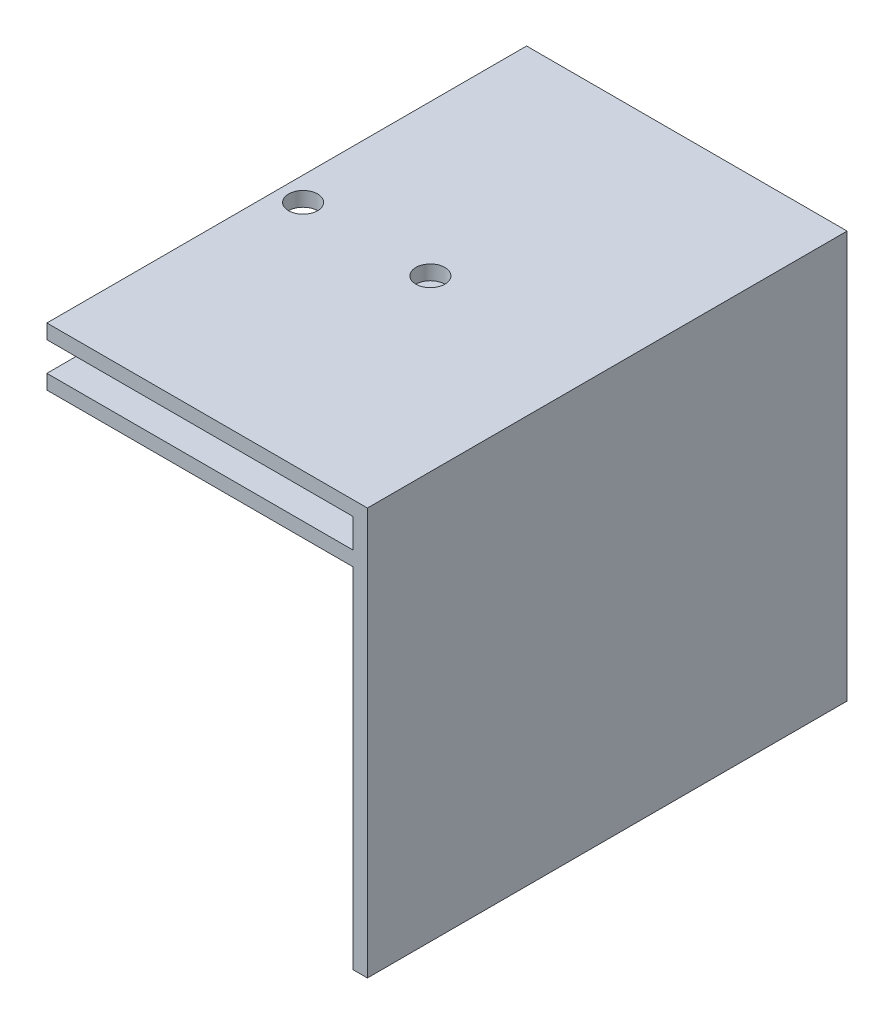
ISO-10303-21;
HEADER;
FILE_DESCRIPTION(('STEP AP214'),'2;1');
FILE_NAME('part.step','',(''),(''),'','','');
FILE_SCHEMA(('AUTOMOTIVE_DESIGN { 1 0 10303 214 1 1 1 1 }'));
ENDSEC;
DATA;
#1=APPLICATION_CONTEXT('core data for automotive mechanical design processes');
#2=APPLICATION_PROTOCOL_DEFINITION('international standard','automotive_design',2000,#1);
#3=PRODUCT_CONTEXT('',#1,'mechanical');
#4=PRODUCT('Part','Part','',(#3));
#5=PRODUCT_RELATED_PRODUCT_CATEGORY('part','',(#4));
#6=PRODUCT_DEFINITION_FORMATION('','',#4);
#7=PRODUCT_DEFINITION_CONTEXT('part definition',#1,'design');
#8=PRODUCT_DEFINITION('design','',#6,#7);
#9=PRODUCT_DEFINITION_SHAPE('','',#8);
#10=(LENGTH_UNIT() NAMED_UNIT(*) SI_UNIT(.MILLI.,.METRE.));
#11=(NAMED_UNIT(*) PLANE_ANGLE_UNIT() SI_UNIT($,.RADIAN.));
#12=(NAMED_UNIT(*) SI_UNIT($,.STERADIAN.) SOLID_ANGLE_UNIT());
#13=UNCERTAINTY_MEASURE_WITH_UNIT(LENGTH_MEASURE(1.E-05),#10,'distance_accuracy_value','');
#14=(GEOMETRIC_REPRESENTATION_CONTEXT(3) GLOBAL_UNCERTAINTY_ASSIGNED_CONTEXT((#13)) GLOBAL_UNIT_ASSIGNED_CONTEXT((#10,
#11,#12)) REPRESENTATION_CONTEXT('',''));
#15=CARTESIAN_POINT('',(0.,0.,0.));
#16=DIRECTION('',(0.,0.,1.));
#17=DIRECTION('',(1.,0.,0.));
#18=AXIS2_PLACEMENT_3D('',#15,#16,#17);
#19=CARTESIAN_POINT('',(7.93749999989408,76.2,-50.8));
#20=DIRECTION('',(1.,0.,0.));
#21=DIRECTION('',(0.,0.,-1.));
#22=AXIS2_PLACEMENT_3D('',#19,#20,#21);
#23=PLANE('',#22);
#24=DIRECTION('',(0.,0.,1.));
#25=VECTOR('',#24,1.);
#26=CARTESIAN_POINT('',(7.93749999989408,0.,-50.8));
#27=LINE('',#26,#25);
#28=CARTESIAN_POINT('',(7.93749999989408,0.,-53.975));
#29=VERTEX_POINT('',#28);
#30=CARTESIAN_POINT('',(7.93749999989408,0.,-50.8));
#31=VERTEX_POINT('',#30);
#32=EDGE_CURVE('E206',#29,#31,#27,.T.);
#33=ORIENTED_EDGE('',*,*,#32,.T.);
#34=DIRECTION('',(0.,-1.,0.));
#35=VECTOR('',#34,1.);
#36=CARTESIAN_POINT('',(7.93749999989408,76.2,-50.8));
#37=LINE('',#36,#35);
#38=CARTESIAN_POINT('',(7.93749999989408,76.2,-50.8));
#39=VERTEX_POINT('',#38);
#40=EDGE_CURVE('E11',#39,#31,#37,.T.);
#41=ORIENTED_EDGE('',*,*,#40,.F.);
#42=DIRECTION('',(0.,0.,1.));
#43=VECTOR('',#42,1.);
#44=CARTESIAN_POINT('',(7.93749999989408,76.2,-50.8));
#45=LINE('',#44,#43);
#46=CARTESIAN_POINT('',(7.93749999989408,76.2,-53.975));
#47=VERTEX_POINT('',#46);
#48=EDGE_CURVE('E230',#47,#39,#45,.T.);
#49=ORIENTED_EDGE('',*,*,#48,.F.);
#50=DIRECTION('',(0.,-1.,0.));
#51=VECTOR('',#50,1.);
#52=CARTESIAN_POINT('',(7.93749999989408,76.2,-53.975));
#53=LINE('',#52,#51);
#54=EDGE_CURVE('E209',#47,#29,#53,.T.);
#55=ORIENTED_EDGE('',*,*,#54,.T.);
#56=EDGE_LOOP('',(#33,#41,#49,#55));
#57=FACE_BOUND('',#56,.T.);
#58=ADVANCED_FACE('F35',(#57),#23,.F.);
#59=CARTESIAN_POINT('',(7.93749999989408,76.2,-50.8));
#60=DIRECTION('',(0.,0.,-1.));
#61=DIRECTION('',(-1.,0.,0.));
#62=AXIS2_PLACEMENT_3D('',#59,#60,#61);
#63=PLANE('',#62);
#64=DIRECTION('',(1.,0.,0.));
#65=VECTOR('',#64,1.);
#66=CARTESIAN_POINT('',(7.93749999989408,0.,-50.8));
#67=LINE('',#66,#65);
#68=CARTESIAN_POINT('',(33.8709,0.,-50.8));
#69=VERTEX_POINT('',#68);
#70=EDGE_CURVE('E212',#31,#69,#67,.T.);
#71=ORIENTED_EDGE('',*,*,#70,.T.);
#72=DIRECTION('',(0.,-1.,0.));
#73=VECTOR('',#72,1.);
#74=CARTESIAN_POINT('',(33.8709,76.2,-50.8));
#75=LINE('',#74,#73);
#76=CARTESIAN_POINT('',(33.8709,76.2,-50.8));
#77=VERTEX_POINT('',#76);
#78=EDGE_CURVE('E43',#77,#69,#75,.T.);
#79=ORIENTED_EDGE('',*,*,#78,.F.);
#80=DIRECTION('',(1.,0.,0.));
#81=VECTOR('',#80,1.);
#82=CARTESIAN_POINT('',(7.93749999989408,76.2,-50.8));
#83=LINE('',#82,#81);
#84=EDGE_CURVE('E245',#39,#77,#83,.T.);
#85=ORIENTED_EDGE('',*,*,#84,.F.);
#86=ORIENTED_EDGE('',*,*,#40,.T.);
#87=EDGE_LOOP('',(#71,#79,#85,#86));
#88=FACE_BOUND('',#87,.T.);
#89=ADVANCED_FACE('F195',(#88),#63,.F.);
#90=CARTESIAN_POINT('',(33.8709,76.2,50.8));
#91=DIRECTION('',(1.,0.,0.));
#92=DIRECTION('',(0.,0.,-1.));
#93=AXIS2_PLACEMENT_3D('',#90,#91,#92);
#94=PLANE('',#93);
#95=DIRECTION('',(0.,0.,1.));
#96=VECTOR('',#95,1.);
#97=CARTESIAN_POINT('',(33.8709,0.,50.8));
#98=LINE('',#97,#96);
#99=CARTESIAN_POINT('',(33.8709,0.,50.8));
#100=VERTEX_POINT('',#99);
#101=EDGE_CURVE('E215',#69,#100,#98,.T.);
#102=ORIENTED_EDGE('',*,*,#101,.T.);
#103=DIRECTION('',(0.,-1.,0.));
#104=VECTOR('',#103,1.);
#105=CARTESIAN_POINT('',(33.8709,76.2,50.8));
#106=LINE('',#105,#104);
#107=CARTESIAN_POINT('',(33.8709,76.2,50.8));
#108=VERTEX_POINT('',#107);
#109=EDGE_CURVE('E235',#108,#100,#106,.T.);
#110=ORIENTED_EDGE('',*,*,#109,.F.);
#111=DIRECTION('',(0.,0.,1.));
#112=VECTOR('',#111,1.);
#113=CARTESIAN_POINT('',(33.8709,76.2,50.8));
#114=LINE('',#113,#112);
#115=EDGE_CURVE('E242',#77,#108,#114,.T.);
#116=ORIENTED_EDGE('',*,*,#115,.F.);
#117=ORIENTED_EDGE('',*,*,#78,.T.);
#118=EDGE_LOOP('',(#102,#110,#116,#117));
#119=FACE_BOUND('',#118,.T.);
#120=ADVANCED_FACE('F200',(#119),#94,.F.);
#121=CARTESIAN_POINT('',(33.8709,76.2,50.8));
#122=DIRECTION('',(0.,0.,-1.));
#123=DIRECTION('',(-1.,0.,0.));
#124=AXIS2_PLACEMENT_3D('',#121,#122,#123);
#125=PLANE('',#124);
#126=DIRECTION('',(1.,0.,0.));
#127=VECTOR('',#126,1.);
#128=CARTESIAN_POINT('',(33.8709,0.,50.8));
#129=LINE('',#128,#127);
#130=CARTESIAN_POINT('',(37.0459,0.,50.8));
#131=VERTEX_POINT('',#130);
#132=EDGE_CURVE('E224',#100,#131,#129,.T.);
#133=ORIENTED_EDGE('',*,*,#132,.T.);
#134=DIRECTION('',(0.,-1.,0.));
#135=VECTOR('',#134,1.);
#136=CARTESIAN_POINT('',(37.0459,76.2,50.8));
#137=LINE('',#136,#135);
#138=CARTESIAN_POINT('',(37.0459,88.9,50.8));
#139=VERTEX_POINT('',#138);
#140=EDGE_CURVE('E131',#139,#131,#137,.T.);
#141=ORIENTED_EDGE('',*,*,#140,.F.);
#142=DIRECTION('',(1.,0.,0.));
#143=VECTOR('',#142,1.);
#144=CARTESIAN_POINT('',(-32.9608765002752,88.9,50.8));
#145=LINE('',#144,#143);
#146=CARTESIAN_POINT('',(-32.9608765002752,88.9,50.8));
#147=VERTEX_POINT('',#146);
#148=EDGE_CURVE('E124',#147,#139,#145,.T.);
#149=ORIENTED_EDGE('',*,*,#148,.F.);
#150=DIRECTION('',(0.,-1.,0.));
#151=VECTOR('',#150,1.);
#152=CARTESIAN_POINT('',(-32.9608765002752,88.9,50.8));
#153=LINE('',#152,#151);
#154=CARTESIAN_POINT('',(-32.9608765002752,85.725,50.8));
#155=VERTEX_POINT('',#154);
#156=EDGE_CURVE('E129',#147,#155,#153,.T.);
#157=ORIENTED_EDGE('',*,*,#156,.T.);
#158=DIRECTION('',(1.,0.,0.));
#159=VECTOR('',#158,1.);
#160=CARTESIAN_POINT('',(-32.9608765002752,85.725,50.8));
#161=LINE('',#160,#159);
#162=CARTESIAN_POINT('',(33.8709,85.725,50.8));
#163=VERTEX_POINT('',#162);
#164=EDGE_CURVE('E146',#155,#163,#161,.T.);
#165=ORIENTED_EDGE('',*,*,#164,.T.);
#166=DIRECTION('',(0.,-1.,0.));
#167=VECTOR('',#166,1.);
#168=CARTESIAN_POINT('',(33.8709,85.725,50.8));
#169=LINE('',#168,#167);
#170=CARTESIAN_POINT('',(33.8709,79.375,50.8));
#171=VERTEX_POINT('',#170);
#172=EDGE_CURVE('E299',#163,#171,#169,.T.);
#173=ORIENTED_EDGE('',*,*,#172,.T.);
#174=DIRECTION('',(1.,0.,0.));
#175=VECTOR('',#174,1.);
#176=CARTESIAN_POINT('',(37.0459,79.375,50.8));
#177=LINE('',#176,#175);
#178=CARTESIAN_POINT('',(-32.9608765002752,79.375,50.8));
#179=VERTEX_POINT('',#178);
#180=EDGE_CURVE('E252',#179,#171,#177,.T.);
#181=ORIENTED_EDGE('',*,*,#180,.F.);
#182=DIRECTION('',(0.,-1.,0.));
#183=VECTOR('',#182,1.);
#184=CARTESIAN_POINT('',(-32.9608765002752,79.375,50.8));
#185=LINE('',#184,#183);
#186=CARTESIAN_POINT('',(-32.9608765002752,76.2,50.8));
#187=VERTEX_POINT('',#186);
#188=EDGE_CURVE('E217',#179,#187,#185,.T.);
#189=ORIENTED_EDGE('',*,*,#188,.T.);
#190=DIRECTION('',(1.,0.,0.));
#191=VECTOR('',#190,1.);
#192=CARTESIAN_POINT('',(37.0459,76.2,50.8));
#193=LINE('',#192,#191);
#194=EDGE_CURVE('E270',#187,#108,#193,.T.);
#195=ORIENTED_EDGE('',*,*,#194,.T.);
#196=ORIENTED_EDGE('',*,*,#109,.T.);
#197=EDGE_LOOP('',(#133,#141,#149,#157,#165,#173,#181,#189,#195,#196));
#198=FACE_BOUND('',#197,.T.);
#199=ADVANCED_FACE('F126',(#198),#125,.F.);
#200=CARTESIAN_POINT('',(37.0459,76.2,50.8));
#201=DIRECTION('',(-1.,0.,0.));
#202=DIRECTION('',(0.,0.,1.));
#203=AXIS2_PLACEMENT_3D('',#200,#201,#202);
#204=PLANE('',#203);
#205=DIRECTION('',(0.,0.,-1.));
#206=VECTOR('',#205,1.);
#207=CARTESIAN_POINT('',(37.0459,0.,50.8));
#208=LINE('',#207,#206);
#209=CARTESIAN_POINT('',(37.0459,0.,-53.975));
#210=VERTEX_POINT('',#209);
#211=EDGE_CURVE('E226',#131,#210,#208,.T.);
#212=ORIENTED_EDGE('',*,*,#211,.T.);
#213=DIRECTION('',(0.,-1.,0.));
#214=VECTOR('',#213,1.);
#215=CARTESIAN_POINT('',(37.0459,76.2,-53.975));
#216=LINE('',#215,#214);
#217=CARTESIAN_POINT('',(37.0459,88.9,-53.975));
#218=VERTEX_POINT('',#217);
#219=EDGE_CURVE('E231',#218,#210,#216,.T.);
#220=ORIENTED_EDGE('',*,*,#219,.F.);
#221=DIRECTION('',(0.,0.,-1.));
#222=VECTOR('',#221,1.);
#223=CARTESIAN_POINT('',(37.0459,88.9,-53.975));
#224=LINE('',#223,#222);
#225=EDGE_CURVE('E135',#139,#218,#224,.T.);
#226=ORIENTED_EDGE('',*,*,#225,.F.);
#227=ORIENTED_EDGE('',*,*,#140,.T.);
#228=EDGE_LOOP('',(#212,#220,#226,#227));
#229=FACE_BOUND('',#228,.T.);
#230=ADVANCED_FACE('F289',(#229),#204,.F.);
#231=CARTESIAN_POINT('',(7.93749999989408,76.2,-53.975));
#232=DIRECTION('',(0.,0.,1.));
#233=DIRECTION('',(1.,0.,0.));
#234=AXIS2_PLACEMENT_3D('',#231,#232,#233);
#235=PLANE('',#234);
#236=DIRECTION('',(-1.,0.,0.));
#237=VECTOR('',#236,1.);
#238=CARTESIAN_POINT('',(7.93749999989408,0.,-53.975));
#239=LINE('',#238,#237);
#240=EDGE_CURVE('E228',#210,#29,#239,.T.);
#241=ORIENTED_EDGE('',*,*,#240,.T.);
#242=ORIENTED_EDGE('',*,*,#54,.F.);
#243=DIRECTION('',(-1.,0.,0.));
#244=VECTOR('',#243,1.);
#245=CARTESIAN_POINT('',(37.0459,76.2,-53.975));
#246=LINE('',#245,#244);
#247=CARTESIAN_POINT('',(-32.9608765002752,76.2,-53.975));
#248=VERTEX_POINT('',#247);
#249=EDGE_CURVE('E273',#47,#248,#246,.T.);
#250=ORIENTED_EDGE('',*,*,#249,.T.);
#251=DIRECTION('',(0.,-1.,0.));
#252=VECTOR('',#251,1.);
#253=CARTESIAN_POINT('',(-32.9608765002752,79.375,-53.975));
#254=LINE('',#253,#252);
#255=CARTESIAN_POINT('',(-32.9608765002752,88.9,-53.975));
#256=VERTEX_POINT('',#255);
#257=EDGE_CURVE('E213',#256,#248,#254,.T.);
#258=ORIENTED_EDGE('',*,*,#257,.F.);
#259=DIRECTION('',(-1.,0.,0.));
#260=VECTOR('',#259,1.);
#261=CARTESIAN_POINT('',(-32.9608765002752,88.9,-53.975));
#262=LINE('',#261,#260);
#263=EDGE_CURVE('E143',#218,#256,#262,.T.);
#264=ORIENTED_EDGE('',*,*,#263,.F.);
#265=ORIENTED_EDGE('',*,*,#219,.T.);
#266=EDGE_LOOP('',(#241,#242,#250,#258,#264,#265));
#267=FACE_BOUND('',#266,.T.);
#268=ADVANCED_FACE('F291',(#267),#235,.F.);
#269=CARTESIAN_POINT('',(7.93749999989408,0.,-53.975));
#270=DIRECTION('',(0.,-1.,0.));
#271=DIRECTION('',(0.,0.,-1.));
#272=AXIS2_PLACEMENT_3D('',#269,#270,#271);
#273=PLANE('',#272);
#274=ORIENTED_EDGE('',*,*,#32,.F.);
#275=ORIENTED_EDGE('',*,*,#240,.F.);
#276=ORIENTED_EDGE('',*,*,#211,.F.);
#277=ORIENTED_EDGE('',*,*,#132,.F.);
#278=ORIENTED_EDGE('',*,*,#101,.F.);
#279=ORIENTED_EDGE('',*,*,#70,.F.);
#280=EDGE_LOOP('',(#274,#275,#276,#277,#278,#279));
#281=FACE_BOUND('',#280,.T.);
#282=ADVANCED_FACE('F287',(#281),#273,.T.);
#283=CARTESIAN_POINT('',(-32.9608765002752,76.2,50.8));
#284=DIRECTION('',(0.,1.,0.));
#285=DIRECTION('',(0.,0.,1.));
#286=AXIS2_PLACEMENT_3D('',#283,#284,#285);
#287=PLANE('',#286);
#288=CARTESIAN_POINT('',(-27.8002995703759,76.2,0.));
#289=DIRECTION('',(0.,1.,0.));
#290=DIRECTION('',(0.,0.,1.));
#291=AXIS2_PLACEMENT_3D('',#288,#289,#290);
#292=CIRCLE('',#291,3.175);
#293=CARTESIAN_POINT('',(-27.8002995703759,76.2,3.175));
#294=VERTEX_POINT('',#293);
#295=EDGE_CURVE('E305',#294,#294,#292,.T.);
#296=ORIENTED_EDGE('',*,*,#295,.T.);
#297=EDGE_LOOP('',(#296));
#298=FACE_BOUND('',#297,.T.);
#299=CARTESIAN_POINT('',(0.,76.2,0.));
#300=DIRECTION('',(0.,1.,0.));
#301=DIRECTION('',(0.,0.,1.));
#302=AXIS2_PLACEMENT_3D('',#299,#300,#301);
#303=CIRCLE('',#302,3.175);
#304=CARTESIAN_POINT('',(0.,76.2,3.175));
#305=VERTEX_POINT('',#304);
#306=EDGE_CURVE('E261',#305,#305,#303,.T.);
#307=ORIENTED_EDGE('',*,*,#306,.T.);
#308=EDGE_LOOP('',(#307));
#309=FACE_BOUND('',#308,.T.);
#310=ORIENTED_EDGE('',*,*,#249,.F.);
#311=ORIENTED_EDGE('',*,*,#48,.T.);
#312=ORIENTED_EDGE('',*,*,#84,.T.);
#313=ORIENTED_EDGE('',*,*,#115,.T.);
#314=ORIENTED_EDGE('',*,*,#194,.F.);
#315=DIRECTION('',(0.,0.,1.));
#316=VECTOR('',#315,1.);
#317=CARTESIAN_POINT('',(-32.9608765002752,76.2,-53.975));
#318=LINE('',#317,#316);
#319=EDGE_CURVE('E256',#248,#187,#318,.T.);
#320=ORIENTED_EDGE('',*,*,#319,.F.);
#321=EDGE_LOOP('',(#310,#311,#312,#313,#314,#320));
#322=FACE_BOUND('',#321,.T.);
#323=ADVANCED_FACE('F279',(#298,#309,#322),#287,.F.);
#324=CARTESIAN_POINT('',(-32.9608765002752,79.375,50.8));
#325=DIRECTION('',(0.,1.,0.));
#326=DIRECTION('',(0.,0.,1.));
#327=AXIS2_PLACEMENT_3D('',#324,#325,#326);
#328=PLANE('',#327);
#329=DIRECTION('',(1.,0.,0.));
#330=VECTOR('',#329,1.);
#331=CARTESIAN_POINT('',(-96.1123952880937,79.375,-50.8));
#332=LINE('',#331,#330);
#333=CARTESIAN_POINT('',(-32.9608765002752,79.375,-50.8));
#334=VERTEX_POINT('',#333);
#335=CARTESIAN_POINT('',(33.8709,79.375,-50.8));
#336=VERTEX_POINT('',#335);
#337=EDGE_CURVE('E56',#334,#336,#332,.T.);
#338=ORIENTED_EDGE('',*,*,#337,.F.);
#339=DIRECTION('',(0.,0.,1.));
#340=VECTOR('',#339,1.);
#341=CARTESIAN_POINT('',(-32.9608765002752,79.375,-53.975));
#342=LINE('',#341,#340);
#343=EDGE_CURVE('E255',#334,#179,#342,.T.);
#344=ORIENTED_EDGE('',*,*,#343,.T.);
#345=ORIENTED_EDGE('',*,*,#180,.T.);
#346=DIRECTION('',(0.,0.,1.));
#347=VECTOR('',#346,1.);
#348=CARTESIAN_POINT('',(33.8709,79.375,-1.58750000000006));
#349=LINE('',#348,#347);
#350=EDGE_CURVE('E51',#336,#171,#349,.T.);
#351=ORIENTED_EDGE('',*,*,#350,.F.);
#352=EDGE_LOOP('',(#338,#344,#345,#351));
#353=FACE_BOUND('',#352,.T.);
#354=CARTESIAN_POINT('',(0.,79.375,0.));
#355=DIRECTION('',(0.,1.,0.));
#356=DIRECTION('',(0.,0.,1.));
#357=AXIS2_PLACEMENT_3D('',#354,#355,#356);
#358=CIRCLE('',#357,3.175);
#359=CARTESIAN_POINT('',(0.,79.375,3.175));
#360=VERTEX_POINT('',#359);
#361=EDGE_CURVE('E274',#360,#360,#358,.T.);
#362=ORIENTED_EDGE('',*,*,#361,.F.);
#363=EDGE_LOOP('',(#362));
#364=FACE_BOUND('',#363,.T.);
#365=CARTESIAN_POINT('',(-27.8002995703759,79.375,0.));
#366=DIRECTION('',(0.,1.,0.));
#367=DIRECTION('',(0.,0.,1.));
#368=AXIS2_PLACEMENT_3D('',#365,#366,#367);
#369=CIRCLE('',#368,3.175);
#370=CARTESIAN_POINT('',(-27.8002995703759,79.375,3.175));
#371=VERTEX_POINT('',#370);
#372=EDGE_CURVE('E321',#371,#371,#369,.T.);
#373=ORIENTED_EDGE('',*,*,#372,.F.);
#374=EDGE_LOOP('',(#373));
#375=FACE_BOUND('',#374,.T.);
#376=ADVANCED_FACE('F295',(#353,#364,#375),#328,.T.);
#377=CARTESIAN_POINT('',(-32.9608765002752,79.375,-53.975));
#378=DIRECTION('',(1.,0.,0.));
#379=DIRECTION('',(0.,0.,-1.));
#380=AXIS2_PLACEMENT_3D('',#377,#378,#379);
#381=PLANE('',#380);
#382=ORIENTED_EDGE('',*,*,#319,.T.);
#383=ORIENTED_EDGE('',*,*,#188,.F.);
#384=ORIENTED_EDGE('',*,*,#343,.F.);
#385=DIRECTION('',(0.,-1.,0.));
#386=VECTOR('',#385,1.);
#387=CARTESIAN_POINT('',(-32.9608765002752,85.725,-50.8));
#388=LINE('',#387,#386);
#389=CARTESIAN_POINT('',(-32.9608765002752,85.725,-50.8));
#390=VERTEX_POINT('',#389);
#391=EDGE_CURVE('E303',#390,#334,#388,.T.);
#392=ORIENTED_EDGE('',*,*,#391,.F.);
#393=DIRECTION('',(0.,0.,1.));
#394=VECTOR('',#393,1.);
#395=CARTESIAN_POINT('',(-32.9608765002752,85.725,-53.975));
#396=LINE('',#395,#394);
#397=EDGE_CURVE('E150',#390,#155,#396,.T.);
#398=ORIENTED_EDGE('',*,*,#397,.T.);
#399=ORIENTED_EDGE('',*,*,#156,.F.);
#400=DIRECTION('',(0.,0.,1.));
#401=VECTOR('',#400,1.);
#402=CARTESIAN_POINT('',(-32.9608765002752,88.9,-53.975));
#403=LINE('',#402,#401);
#404=EDGE_CURVE('E136',#256,#147,#403,.T.);
#405=ORIENTED_EDGE('',*,*,#404,.F.);
#406=ORIENTED_EDGE('',*,*,#257,.T.);
#407=EDGE_LOOP('',(#382,#383,#384,#392,#398,#399,#405,#406));
#408=FACE_BOUND('',#407,.T.);
#409=ADVANCED_FACE('F148',(#408),#381,.F.);
#410=CARTESIAN_POINT('',(0.,79.375,0.));
#411=DIRECTION('',(0.,-1.,0.));
#412=DIRECTION('',(0.,0.,-1.));
#413=AXIS2_PLACEMENT_3D('',#410,#411,#412);
#414=CYLINDRICAL_SURFACE('',#413,3.175);
#415=ORIENTED_EDGE('',*,*,#361,.T.);
#416=EDGE_LOOP('',(#415));
#417=FACE_BOUND('',#416,.T.);
#418=ORIENTED_EDGE('',*,*,#306,.F.);
#419=EDGE_LOOP('',(#418));
#420=FACE_BOUND('',#419,.T.);
#421=ADVANCED_FACE('F332',(#417,#420),#414,.F.);
#422=CARTESIAN_POINT('',(-27.8002995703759,79.375,0.));
#423=DIRECTION('',(0.,-1.,0.));
#424=DIRECTION('',(0.,0.,-1.));
#425=AXIS2_PLACEMENT_3D('',#422,#423,#424);
#426=CYLINDRICAL_SURFACE('',#425,3.175);
#427=ORIENTED_EDGE('',*,*,#372,.T.);
#428=EDGE_LOOP('',(#427));
#429=FACE_BOUND('',#428,.T.);
#430=ORIENTED_EDGE('',*,*,#295,.F.);
#431=EDGE_LOOP('',(#430));
#432=FACE_BOUND('',#431,.T.);
#433=ADVANCED_FACE('F334',(#429,#432),#426,.F.);
#434=CARTESIAN_POINT('',(-96.1123952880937,85.725,-50.8));
#435=DIRECTION('',(0.,0.,-1.));
#436=DIRECTION('',(-1.,0.,0.));
#437=AXIS2_PLACEMENT_3D('',#434,#435,#436);
#438=PLANE('',#437);
#439=ORIENTED_EDGE('',*,*,#337,.T.);
#440=DIRECTION('',(0.,-1.,0.));
#441=VECTOR('',#440,1.);
#442=CARTESIAN_POINT('',(33.8709,85.725,-50.8));
#443=LINE('',#442,#441);
#444=CARTESIAN_POINT('',(33.8709,85.725,-50.8));
#445=VERTEX_POINT('',#444);
#446=EDGE_CURVE('E302',#445,#336,#443,.T.);
#447=ORIENTED_EDGE('',*,*,#446,.F.);
#448=DIRECTION('',(1.,0.,0.));
#449=VECTOR('',#448,1.);
#450=CARTESIAN_POINT('',(-96.1123952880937,85.725,-50.8));
#451=LINE('',#450,#449);
#452=EDGE_CURVE('E317',#390,#445,#451,.T.);
#453=ORIENTED_EDGE('',*,*,#452,.F.);
#454=ORIENTED_EDGE('',*,*,#391,.T.);
#455=EDGE_LOOP('',(#439,#447,#453,#454));
#456=FACE_BOUND('',#455,.T.);
#457=ADVANCED_FACE('F340',(#456),#438,.F.);
#458=CARTESIAN_POINT('',(33.8709,85.725,-1.58750000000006));
#459=DIRECTION('',(1.,0.,0.));
#460=DIRECTION('',(0.,0.,-1.));
#461=AXIS2_PLACEMENT_3D('',#458,#459,#460);
#462=PLANE('',#461);
#463=ORIENTED_EDGE('',*,*,#350,.T.);
#464=ORIENTED_EDGE('',*,*,#172,.F.);
#465=DIRECTION('',(0.,0.,1.));
#466=VECTOR('',#465,1.);
#467=CARTESIAN_POINT('',(33.8709,85.725,-1.58750000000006));
#468=LINE('',#467,#466);
#469=EDGE_CURVE('E307',#445,#163,#468,.T.);
#470=ORIENTED_EDGE('',*,*,#469,.F.);
#471=ORIENTED_EDGE('',*,*,#446,.T.);
#472=EDGE_LOOP('',(#463,#464,#470,#471));
#473=FACE_BOUND('',#472,.T.);
#474=ADVANCED_FACE('F190',(#473),#462,.F.);
#475=CARTESIAN_POINT('',(-32.9608765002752,85.725,50.8));
#476=DIRECTION('',(0.,1.,0.));
#477=DIRECTION('',(0.,0.,1.));
#478=AXIS2_PLACEMENT_3D('',#475,#476,#477);
#479=PLANE('',#478);
#480=CARTESIAN_POINT('',(-27.8002995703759,85.725,0.));
#481=DIRECTION('',(0.,1.,0.));
#482=DIRECTION('',(0.,0.,1.));
#483=AXIS2_PLACEMENT_3D('',#480,#481,#482);
#484=CIRCLE('',#483,3.175);
#485=CARTESIAN_POINT('',(-27.8002995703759,85.725,3.175));
#486=VERTEX_POINT('',#485);
#487=EDGE_CURVE('E171',#486,#486,#484,.T.);
#488=ORIENTED_EDGE('',*,*,#487,.T.);
#489=EDGE_LOOP('',(#488));
#490=FACE_BOUND('',#489,.T.);
#491=CARTESIAN_POINT('',(0.,85.725,0.));
#492=DIRECTION('',(0.,1.,0.));
#493=DIRECTION('',(0.,0.,1.));
#494=AXIS2_PLACEMENT_3D('',#491,#492,#493);
#495=CIRCLE('',#494,3.175);
#496=CARTESIAN_POINT('',(0.,85.725,3.175));
#497=VERTEX_POINT('',#496);
#498=EDGE_CURVE('E165',#497,#497,#495,.T.);
#499=ORIENTED_EDGE('',*,*,#498,.T.);
#500=EDGE_LOOP('',(#499));
#501=FACE_BOUND('',#500,.T.);
#502=ORIENTED_EDGE('',*,*,#397,.F.);
#503=ORIENTED_EDGE('',*,*,#452,.T.);
#504=ORIENTED_EDGE('',*,*,#469,.T.);
#505=ORIENTED_EDGE('',*,*,#164,.F.);
#506=EDGE_LOOP('',(#502,#503,#504,#505));
#507=FACE_BOUND('',#506,.T.);
#508=ADVANCED_FACE('F181',(#490,#501,#507),#479,.F.);
#509=CARTESIAN_POINT('',(-32.9608765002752,88.9,50.8));
#510=DIRECTION('',(0.,1.,0.));
#511=DIRECTION('',(0.,0.,1.));
#512=AXIS2_PLACEMENT_3D('',#509,#510,#511);
#513=PLANE('',#512);
#514=CARTESIAN_POINT('',(0.,88.9,0.));
#515=DIRECTION('',(0.,1.,0.));
#516=DIRECTION('',(0.,0.,1.));
#517=AXIS2_PLACEMENT_3D('',#514,#515,#516);
#518=CIRCLE('',#517,3.175);
#519=CARTESIAN_POINT('',(0.,88.9,3.175));
#520=VERTEX_POINT('',#519);
#521=EDGE_CURVE('E160',#520,#520,#518,.T.);
#522=ORIENTED_EDGE('',*,*,#521,.F.);
#523=EDGE_LOOP('',(#522));
#524=FACE_BOUND('',#523,.T.);
#525=ORIENTED_EDGE('',*,*,#404,.T.);
#526=ORIENTED_EDGE('',*,*,#148,.T.);
#527=ORIENTED_EDGE('',*,*,#225,.T.);
#528=ORIENTED_EDGE('',*,*,#263,.T.);
#529=EDGE_LOOP('',(#525,#526,#527,#528));
#530=FACE_BOUND('',#529,.T.);
#531=CARTESIAN_POINT('',(-27.8002995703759,88.9,0.));
#532=DIRECTION('',(0.,1.,0.));
#533=DIRECTION('',(0.,0.,1.));
#534=AXIS2_PLACEMENT_3D('',#531,#532,#533);
#535=CIRCLE('',#534,3.175);
#536=CARTESIAN_POINT('',(-27.8002995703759,88.9,3.175));
#537=VERTEX_POINT('',#536);
#538=EDGE_CURVE('E168',#537,#537,#535,.T.);
#539=ORIENTED_EDGE('',*,*,#538,.F.);
#540=EDGE_LOOP('',(#539));
#541=FACE_BOUND('',#540,.T.);
#542=ADVANCED_FACE('F140',(#524,#530,#541),#513,.T.);
#543=CARTESIAN_POINT('',(0.,88.9,0.));
#544=DIRECTION('',(0.,-1.,0.));
#545=DIRECTION('',(0.,0.,-1.));
#546=AXIS2_PLACEMENT_3D('',#543,#544,#545);
#547=CYLINDRICAL_SURFACE('',#546,3.175);
#548=ORIENTED_EDGE('',*,*,#521,.T.);
#549=EDGE_LOOP('',(#548));
#550=FACE_BOUND('',#549,.T.);
#551=ORIENTED_EDGE('',*,*,#498,.F.);
#552=EDGE_LOOP('',(#551));
#553=FACE_BOUND('',#552,.T.);
#554=ADVANCED_FACE('F180',(#550,#553),#547,.F.);
#555=CARTESIAN_POINT('',(-27.8002995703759,88.9,0.));
#556=DIRECTION('',(0.,-1.,0.));
#557=DIRECTION('',(0.,0.,-1.));
#558=AXIS2_PLACEMENT_3D('',#555,#556,#557);
#559=CYLINDRICAL_SURFACE('',#558,3.175);
#560=ORIENTED_EDGE('',*,*,#538,.T.);
#561=EDGE_LOOP('',(#560));
#562=FACE_BOUND('',#561,.T.);
#563=ORIENTED_EDGE('',*,*,#487,.F.);
#564=EDGE_LOOP('',(#563));
#565=FACE_BOUND('',#564,.T.);
#566=ADVANCED_FACE('F177',(#562,#565),#559,.F.);
#567=CLOSED_SHELL('',(#58,#89,#120,#199,#230,#268,#282,#323,#376,#409,#421,#433,#457,#474,#508,
#542,#554,#566));
#568=MANIFOLD_SOLID_BREP('B2',#567);
#569=ADVANCED_BREP_SHAPE_REPRESENTATION('',(#18,#568),#14);
#570=SHAPE_DEFINITION_REPRESENTATION(#9,#569);
ENDSEC;
END-ISO-10303-21;
